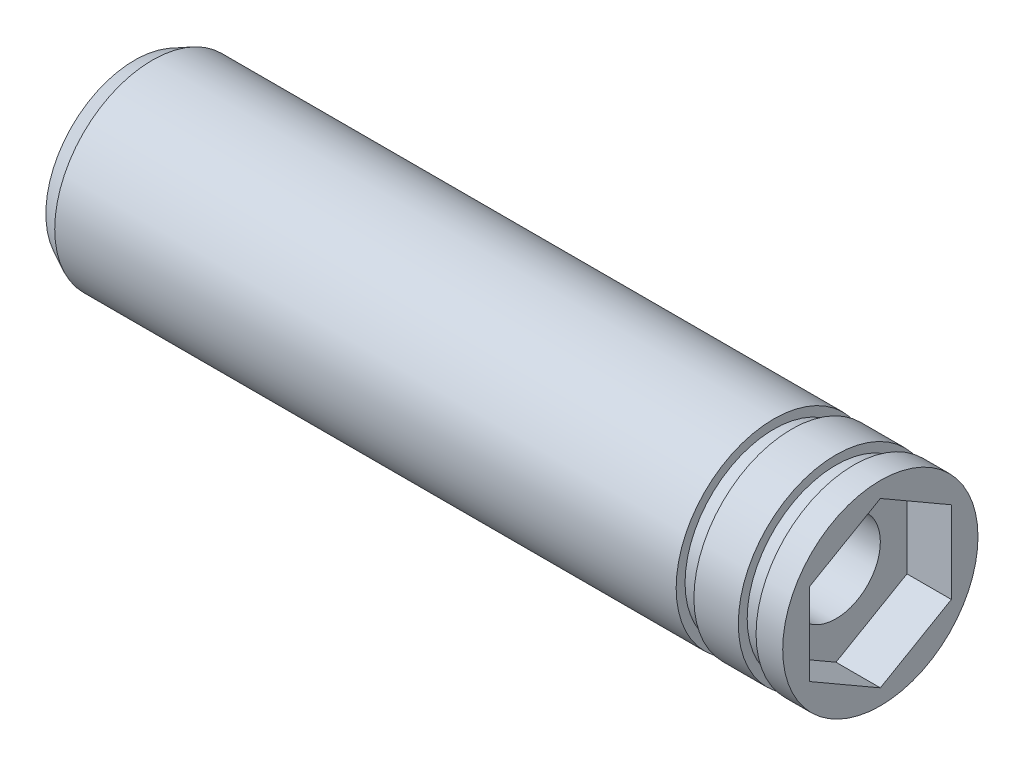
ISO-10303-21;
HEADER;
FILE_DESCRIPTION(('STEP AP214'),'2;1');
FILE_NAME('part.step','',(''),(''),'','','');
FILE_SCHEMA(('AUTOMOTIVE_DESIGN { 1 0 10303 214 1 1 1 1 }'));
ENDSEC;
DATA;
#1=APPLICATION_CONTEXT('core data for automotive mechanical design processes');
#2=APPLICATION_PROTOCOL_DEFINITION('international standard','automotive_design',2000,#1);
#3=PRODUCT_CONTEXT('',#1,'mechanical');
#4=PRODUCT('Part','Part','',(#3));
#5=PRODUCT_RELATED_PRODUCT_CATEGORY('part','',(#4));
#6=PRODUCT_DEFINITION_FORMATION('','',#4);
#7=PRODUCT_DEFINITION_CONTEXT('part definition',#1,'design');
#8=PRODUCT_DEFINITION('design','',#6,#7);
#9=PRODUCT_DEFINITION_SHAPE('','',#8);
#10=(LENGTH_UNIT() NAMED_UNIT(*) SI_UNIT(.MILLI.,.METRE.));
#11=(NAMED_UNIT(*) PLANE_ANGLE_UNIT() SI_UNIT($,.RADIAN.));
#12=(NAMED_UNIT(*) SI_UNIT($,.STERADIAN.) SOLID_ANGLE_UNIT());
#13=UNCERTAINTY_MEASURE_WITH_UNIT(LENGTH_MEASURE(1.E-05),#10,'distance_accuracy_value','');
#14=(GEOMETRIC_REPRESENTATION_CONTEXT(3) GLOBAL_UNCERTAINTY_ASSIGNED_CONTEXT((#13)) GLOBAL_UNIT_ASSIGNED_CONTEXT((#10,
#11,#12)) REPRESENTATION_CONTEXT('',''));
#15=CARTESIAN_POINT('',(0.,0.,0.));
#16=DIRECTION('',(0.,0.,1.));
#17=DIRECTION('',(1.,0.,0.));
#18=AXIS2_PLACEMENT_3D('',#15,#16,#17);
#19=CARTESIAN_POINT('',(0.,0.,0.));
#20=DIRECTION('',(1.,0.,0.));
#21=DIRECTION('',(0.,0.,-1.));
#22=AXIS2_PLACEMENT_3D('',#19,#20,#21);
#23=CYLINDRICAL_SURFACE('',#22,2.5);
#24=CARTESIAN_POINT('',(27.,0.,0.));
#25=DIRECTION('',(-1.,0.,0.));
#26=DIRECTION('',(0.,0.,1.));
#27=AXIS2_PLACEMENT_3D('',#24,#25,#26);
#28=CIRCLE('',#27,2.5);
#29=CARTESIAN_POINT('',(27.,0.,-2.5));
#30=VERTEX_POINT('',#29);
#31=EDGE_CURVE('E242',#30,#30,#28,.F.);
#32=CARTESIAN_POINT('',(39.5,0.,0.));
#33=DIRECTION('',(1.,0.,0.));
#34=DIRECTION('',(0.,0.,-1.));
#35=AXIS2_PLACEMENT_3D('',#32,#33,#34);
#36=CIRCLE('',#35,2.5);
#37=CARTESIAN_POINT('',(39.5,0.,-2.5));
#38=VERTEX_POINT('',#37);
#39=EDGE_CURVE('E28',#38,#38,#36,.F.);
#40=CARTESIAN_POINT('',(27.,0.,-2.5));
#41=CARTESIAN_POINT('',(27.1302083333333,0.,-2.5));
#42=CARTESIAN_POINT('',(27.2604166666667,0.,-2.5));
#43=CARTESIAN_POINT('',(27.5208333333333,0.,-2.5));
#44=CARTESIAN_POINT('',(27.6510416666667,0.,-2.5));
#45=CARTESIAN_POINT('',(27.9114583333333,0.,-2.5));
#46=CARTESIAN_POINT('',(28.0416666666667,0.,-2.5));
#47=CARTESIAN_POINT('',(28.3020833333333,0.,-2.5));
#48=CARTESIAN_POINT('',(28.4322916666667,0.,-2.5));
#49=CARTESIAN_POINT('',(28.6927083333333,0.,-2.5));
#50=CARTESIAN_POINT('',(28.8229166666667,0.,-2.5));
#51=CARTESIAN_POINT('',(29.0833333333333,0.,-2.5));
#52=CARTESIAN_POINT('',(29.2135416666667,0.,-2.5));
#53=CARTESIAN_POINT('',(29.4739583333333,0.,-2.5));
#54=CARTESIAN_POINT('',(29.6041666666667,0.,-2.5));
#55=CARTESIAN_POINT('',(29.8645833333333,0.,-2.5));
#56=CARTESIAN_POINT('',(29.9947916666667,0.,-2.5));
#57=CARTESIAN_POINT('',(30.2552083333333,0.,-2.5));
#58=CARTESIAN_POINT('',(30.3854166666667,0.,-2.5));
#59=CARTESIAN_POINT('',(30.6458333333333,0.,-2.5));
#60=CARTESIAN_POINT('',(30.7760416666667,0.,-2.5));
#61=CARTESIAN_POINT('',(31.0364583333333,0.,-2.5));
#62=CARTESIAN_POINT('',(31.1666666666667,0.,-2.5));
#63=CARTESIAN_POINT('',(31.4270833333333,0.,-2.5));
#64=CARTESIAN_POINT('',(31.5572916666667,0.,-2.5));
#65=CARTESIAN_POINT('',(31.8177083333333,0.,-2.5));
#66=CARTESIAN_POINT('',(31.9479166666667,0.,-2.5));
#67=CARTESIAN_POINT('',(32.2083333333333,0.,-2.5));
#68=CARTESIAN_POINT('',(32.3385416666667,0.,-2.5));
#69=CARTESIAN_POINT('',(32.5989583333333,0.,-2.5));
#70=CARTESIAN_POINT('',(32.7291666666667,0.,-2.5));
#71=CARTESIAN_POINT('',(32.9895833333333,0.,-2.5));
#72=CARTESIAN_POINT('',(33.1197916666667,0.,-2.5));
#73=CARTESIAN_POINT('',(33.3802083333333,0.,-2.5));
#74=CARTESIAN_POINT('',(33.5104166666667,0.,-2.5));
#75=CARTESIAN_POINT('',(33.7708333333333,0.,-2.5));
#76=CARTESIAN_POINT('',(33.9010416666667,0.,-2.5));
#77=CARTESIAN_POINT('',(34.1614583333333,0.,-2.5));
#78=CARTESIAN_POINT('',(34.2916666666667,0.,-2.5));
#79=CARTESIAN_POINT('',(34.5520833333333,0.,-2.5));
#80=CARTESIAN_POINT('',(34.6822916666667,0.,-2.5));
#81=CARTESIAN_POINT('',(34.9427083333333,0.,-2.5));
#82=CARTESIAN_POINT('',(35.0729166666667,0.,-2.5));
#83=CARTESIAN_POINT('',(35.3333333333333,0.,-2.5));
#84=CARTESIAN_POINT('',(35.4635416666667,0.,-2.5));
#85=CARTESIAN_POINT('',(35.7239583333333,0.,-2.5));
#86=CARTESIAN_POINT('',(35.8541666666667,0.,-2.5));
#87=CARTESIAN_POINT('',(36.1145833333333,0.,-2.5));
#88=CARTESIAN_POINT('',(36.2447916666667,0.,-2.5));
#89=CARTESIAN_POINT('',(36.5052083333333,0.,-2.5));
#90=CARTESIAN_POINT('',(36.6354166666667,0.,-2.5));
#91=CARTESIAN_POINT('',(36.8958333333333,0.,-2.5));
#92=CARTESIAN_POINT('',(37.0260416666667,0.,-2.5));
#93=CARTESIAN_POINT('',(37.2864583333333,0.,-2.5));
#94=CARTESIAN_POINT('',(37.4166666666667,0.,-2.5));
#95=CARTESIAN_POINT('',(37.6770833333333,0.,-2.5));
#96=CARTESIAN_POINT('',(37.8072916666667,0.,-2.5));
#97=CARTESIAN_POINT('',(38.0677083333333,0.,-2.5));
#98=CARTESIAN_POINT('',(38.1979166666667,0.,-2.5));
#99=CARTESIAN_POINT('',(38.4583333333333,0.,-2.5));
#100=CARTESIAN_POINT('',(38.5885416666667,0.,-2.5));
#101=CARTESIAN_POINT('',(38.8489583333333,0.,-2.5));
#102=CARTESIAN_POINT('',(38.9791666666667,0.,-2.5));
#103=CARTESIAN_POINT('',(39.2395833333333,0.,-2.5));
#104=CARTESIAN_POINT('',(39.3697916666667,0.,-2.5));
#105=CARTESIAN_POINT('',(39.5,0.,-2.5));
#106=B_SPLINE_CURVE_WITH_KNOTS('',3,(#40,#41,#42,#43,#44,#45,#46,#47,#48,#49,#50,#51,#52,#53,
#54,#55,#56,#57,#58,#59,#60,#61,#62,#63,#64,#65,#66,#67,#68,#69,#70,#71,#72,#73,#74,#75,#76,#77,
#78,#79,#80,#81,#82,#83,#84,#85,#86,#87,#88,#89,#90,#91,#92,#93,#94,#95,#96,#97,#98,#99,#100,
#101,#102,#103,#104,#105),.UNSPECIFIED.,.F.,.F.,(4,2,2,2,2,2,2,2,2,2,2,2,2,2,2,2,2,2,2,2,2,2,2,
2,2,2,2,2,2,2,2,2,4),(0.,0.390624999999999,0.781250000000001,1.171875,1.5625,1.953125,2.34375,
2.734375,3.125,3.515625,3.90625,4.296875,4.6875,5.078125,5.46875,5.859375,6.25,6.640625,7.03125,
7.421875,7.8125,8.20312499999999,8.59375,8.984375,9.375,9.765625,10.15625,10.546875,10.9375,
11.328125,11.71875,12.109375,12.5),.UNSPECIFIED.);
#107=EDGE_CURVE('BSEAM24',#30,#38,#106,.T.);
#108=ORIENTED_EDGE('',*,*,#31,.F.);
#109=ORIENTED_EDGE('',*,*,#39,.F.);
#110=ORIENTED_EDGE('',*,*,#107,.T.);
#111=ORIENTED_EDGE('',*,*,#107,.F.);
#112=EDGE_LOOP('',(#108,#110,#109,#111));
#113=FACE_BOUND('',#112,.T.);
#114=ADVANCED_FACE('F24',(#113),#23,.F.);
#115=CARTESIAN_POINT('',(20.,-3.75277674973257,0.));
#116=DIRECTION('',(0.,-0.866025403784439,0.5));
#117=DIRECTION('',(0.,-0.5,-0.866025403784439));
#118=AXIS2_PLACEMENT_3D('',#115,#116,#117);
#119=PLANE('',#118);
#120=DIRECTION('',(0.,0.5,0.866025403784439));
#121=VECTOR('',#120,1.);
#122=CARTESIAN_POINT('',(7.,-3.75277674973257,0.));
#123=LINE('',#122,#121);
#124=CARTESIAN_POINT('',(7.,-3.75277674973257,0.));
#125=VERTEX_POINT('',#124);
#126=CARTESIAN_POINT('',(7.,-1.87638837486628,3.25));
#127=VERTEX_POINT('',#126);
#128=EDGE_CURVE('E225',#125,#127,#123,.T.);
#129=ORIENTED_EDGE('',*,*,#128,.F.);
#130=DIRECTION('',(-1.,0.,0.));
#131=VECTOR('',#130,1.);
#132=CARTESIAN_POINT('',(20.,-3.75277674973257,0.));
#133=LINE('',#132,#131);
#134=CARTESIAN_POINT('',(0.,-3.75277674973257,0.));
#135=VERTEX_POINT('',#134);
#136=EDGE_CURVE('E281',#125,#135,#133,.T.);
#137=ORIENTED_EDGE('',*,*,#136,.T.);
#138=DIRECTION('',(0.,0.5,0.866025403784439));
#139=VECTOR('',#138,1.);
#140=CARTESIAN_POINT('',(0.,-3.75277674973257,0.));
#141=LINE('',#140,#139);
#142=CARTESIAN_POINT('',(0.,-1.87638837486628,3.25));
#143=VERTEX_POINT('',#142);
#144=EDGE_CURVE('E243',#135,#143,#141,.T.);
#145=ORIENTED_EDGE('',*,*,#144,.T.);
#146=DIRECTION('',(-1.,0.,0.));
#147=VECTOR('',#146,1.);
#148=CARTESIAN_POINT('',(20.,-1.87638837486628,3.25));
#149=LINE('',#148,#147);
#150=EDGE_CURVE('E48',#127,#143,#149,.T.);
#151=ORIENTED_EDGE('',*,*,#150,.F.);
#152=EDGE_LOOP('',(#129,#137,#145,#151));
#153=FACE_BOUND('',#152,.T.);
#154=ADVANCED_FACE('F375',(#153),#119,.F.);
#155=DIRECTION('',(0.,-0.5,-0.866025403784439));
#156=VECTOR('',#155,1.);
#157=CARTESIAN_POINT('',(8.,-3.75277674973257,0.));
#158=LINE('',#157,#156);
#159=CARTESIAN_POINT('',(8.,-1.87638837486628,3.25));
#160=VERTEX_POINT('',#159);
#161=CARTESIAN_POINT('',(8.,-3.75277674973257,0.));
#162=VERTEX_POINT('',#161);
#163=EDGE_CURVE('E223',#160,#162,#158,.T.);
#164=ORIENTED_EDGE('',*,*,#163,.F.);
#165=CARTESIAN_POINT('',(20.,-1.87638837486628,3.25));
#166=VERTEX_POINT('',#165);
#167=EDGE_CURVE('E298',#166,#160,#149,.T.);
#168=ORIENTED_EDGE('',*,*,#167,.F.);
#169=DIRECTION('',(0.,0.5,0.866025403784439));
#170=VECTOR('',#169,1.);
#171=CARTESIAN_POINT('',(20.,-3.75277674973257,0.));
#172=LINE('',#171,#170);
#173=CARTESIAN_POINT('',(20.,-3.75277674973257,0.));
#174=VERTEX_POINT('',#173);
#175=EDGE_CURVE('E259',#174,#166,#172,.T.);
#176=ORIENTED_EDGE('',*,*,#175,.F.);
#177=EDGE_CURVE('E277',#174,#162,#133,.T.);
#178=ORIENTED_EDGE('',*,*,#177,.T.);
#179=EDGE_LOOP('',(#164,#168,#176,#178));
#180=FACE_BOUND('',#179,.T.);
#181=ADVANCED_FACE('F343',(#180),#119,.F.);
#182=CARTESIAN_POINT('',(20.,-1.87638837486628,-3.25));
#183=DIRECTION('',(0.,-0.866025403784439,-0.5));
#184=DIRECTION('',(0.,0.5,-0.866025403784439));
#185=AXIS2_PLACEMENT_3D('',#182,#183,#184);
#186=PLANE('',#185);
#187=DIRECTION('',(0.,-0.5,0.866025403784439));
#188=VECTOR('',#187,1.);
#189=CARTESIAN_POINT('',(7.,-1.87638837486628,-3.25));
#190=LINE('',#189,#188);
#191=CARTESIAN_POINT('',(7.,-1.87638837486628,-3.25));
#192=VERTEX_POINT('',#191);
#193=EDGE_CURVE('E229',#192,#125,#190,.T.);
#194=ORIENTED_EDGE('',*,*,#193,.F.);
#195=DIRECTION('',(-1.,0.,0.));
#196=VECTOR('',#195,1.);
#197=CARTESIAN_POINT('',(20.,-1.87638837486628,-3.25));
#198=LINE('',#197,#196);
#199=CARTESIAN_POINT('',(0.,-1.87638837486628,-3.25));
#200=VERTEX_POINT('',#199);
#201=EDGE_CURVE('E285',#192,#200,#198,.T.);
#202=ORIENTED_EDGE('',*,*,#201,.T.);
#203=DIRECTION('',(0.,-0.5,0.866025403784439));
#204=VECTOR('',#203,1.);
#205=CARTESIAN_POINT('',(0.,-1.87638837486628,-3.25));
#206=LINE('',#205,#204);
#207=EDGE_CURVE('E256',#200,#135,#206,.T.);
#208=ORIENTED_EDGE('',*,*,#207,.T.);
#209=ORIENTED_EDGE('',*,*,#136,.F.);
#210=EDGE_LOOP('',(#194,#202,#208,#209));
#211=FACE_BOUND('',#210,.T.);
#212=ADVANCED_FACE('F394',(#211),#186,.F.);
#213=DIRECTION('',(0.,0.5,-0.866025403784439));
#214=VECTOR('',#213,1.);
#215=CARTESIAN_POINT('',(8.,-1.87638837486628,-3.25));
#216=LINE('',#215,#214);
#217=CARTESIAN_POINT('',(8.,-1.87638837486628,-3.25));
#218=VERTEX_POINT('',#217);
#219=EDGE_CURVE('E221',#162,#218,#216,.T.);
#220=ORIENTED_EDGE('',*,*,#219,.F.);
#221=ORIENTED_EDGE('',*,*,#177,.F.);
#222=DIRECTION('',(0.,-0.5,0.866025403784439));
#223=VECTOR('',#222,1.);
#224=CARTESIAN_POINT('',(20.,-1.87638837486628,-3.25));
#225=LINE('',#224,#223);
#226=CARTESIAN_POINT('',(20.,-1.87638837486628,-3.25));
#227=VERTEX_POINT('',#226);
#228=EDGE_CURVE('E274',#227,#174,#225,.T.);
#229=ORIENTED_EDGE('',*,*,#228,.F.);
#230=EDGE_CURVE('E282',#227,#218,#198,.T.);
#231=ORIENTED_EDGE('',*,*,#230,.T.);
#232=EDGE_LOOP('',(#220,#221,#229,#231));
#233=FACE_BOUND('',#232,.T.);
#234=ADVANCED_FACE('F353',(#233),#186,.F.);
#235=CARTESIAN_POINT('',(20.,1.87638837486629,-3.25));
#236=DIRECTION('',(0.,0.,-1.));
#237=DIRECTION('',(0.,1.,0.));
#238=AXIS2_PLACEMENT_3D('',#235,#236,#237);
#239=PLANE('',#238);
#240=DIRECTION('',(0.,-1.,0.));
#241=VECTOR('',#240,1.);
#242=CARTESIAN_POINT('',(7.,1.87638837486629,-3.25));
#243=LINE('',#242,#241);
#244=CARTESIAN_POINT('',(7.,1.87638837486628,-3.25));
#245=VERTEX_POINT('',#244);
#246=EDGE_CURVE('E233',#245,#192,#243,.T.);
#247=ORIENTED_EDGE('',*,*,#246,.F.);
#248=DIRECTION('',(-1.,0.,0.));
#249=VECTOR('',#248,1.);
#250=CARTESIAN_POINT('',(20.,1.87638837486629,-3.25));
#251=LINE('',#250,#249);
#252=CARTESIAN_POINT('',(0.,1.87638837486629,-3.25));
#253=VERTEX_POINT('',#252);
#254=EDGE_CURVE('E289',#245,#253,#251,.T.);
#255=ORIENTED_EDGE('',*,*,#254,.T.);
#256=DIRECTION('',(0.,-1.,0.));
#257=VECTOR('',#256,1.);
#258=CARTESIAN_POINT('',(0.,1.87638837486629,-3.25));
#259=LINE('',#258,#257);
#260=EDGE_CURVE('E253',#253,#200,#259,.T.);
#261=ORIENTED_EDGE('',*,*,#260,.T.);
#262=ORIENTED_EDGE('',*,*,#201,.F.);
#263=EDGE_LOOP('',(#247,#255,#261,#262));
#264=FACE_BOUND('',#263,.T.);
#265=ADVANCED_FACE('F398',(#264),#239,.F.);
#266=DIRECTION('',(0.,1.,0.));
#267=VECTOR('',#266,1.);
#268=CARTESIAN_POINT('',(8.,1.87638837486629,-3.25));
#269=LINE('',#268,#267);
#270=CARTESIAN_POINT('',(8.,1.87638837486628,-3.25));
#271=VERTEX_POINT('',#270);
#272=EDGE_CURVE('E219',#218,#271,#269,.T.);
#273=ORIENTED_EDGE('',*,*,#272,.F.);
#274=ORIENTED_EDGE('',*,*,#230,.F.);
#275=DIRECTION('',(0.,-1.,0.));
#276=VECTOR('',#275,1.);
#277=CARTESIAN_POINT('',(20.,1.87638837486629,-3.25));
#278=LINE('',#277,#276);
#279=CARTESIAN_POINT('',(20.,1.87638837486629,-3.25));
#280=VERTEX_POINT('',#279);
#281=EDGE_CURVE('E271',#280,#227,#278,.T.);
#282=ORIENTED_EDGE('',*,*,#281,.F.);
#283=EDGE_CURVE('E286',#280,#271,#251,.T.);
#284=ORIENTED_EDGE('',*,*,#283,.T.);
#285=EDGE_LOOP('',(#273,#274,#282,#284));
#286=FACE_BOUND('',#285,.T.);
#287=ADVANCED_FACE('F357',(#286),#239,.F.);
#288=CARTESIAN_POINT('',(20.,3.75277674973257,0.));
#289=DIRECTION('',(0.,0.866025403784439,-0.5));
#290=DIRECTION('',(0.,0.5,0.866025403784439));
#291=AXIS2_PLACEMENT_3D('',#288,#289,#290);
#292=PLANE('',#291);
#293=DIRECTION('',(0.,-0.5,-0.866025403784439));
#294=VECTOR('',#293,1.);
#295=CARTESIAN_POINT('',(7.,3.75277674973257,0.));
#296=LINE('',#295,#294);
#297=CARTESIAN_POINT('',(7.,3.75277674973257,0.));
#298=VERTEX_POINT('',#297);
#299=EDGE_CURVE('E231',#298,#245,#296,.T.);
#300=ORIENTED_EDGE('',*,*,#299,.F.);
#301=DIRECTION('',(-1.,0.,0.));
#302=VECTOR('',#301,1.);
#303=CARTESIAN_POINT('',(20.,3.75277674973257,0.));
#304=LINE('',#303,#302);
#305=CARTESIAN_POINT('',(0.,3.75277674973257,0.));
#306=VERTEX_POINT('',#305);
#307=EDGE_CURVE('E293',#298,#306,#304,.T.);
#308=ORIENTED_EDGE('',*,*,#307,.T.);
#309=DIRECTION('',(0.,-0.5,-0.866025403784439));
#310=VECTOR('',#309,1.);
#311=CARTESIAN_POINT('',(0.,3.75277674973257,0.));
#312=LINE('',#311,#310);
#313=EDGE_CURVE('E250',#306,#253,#312,.T.);
#314=ORIENTED_EDGE('',*,*,#313,.T.);
#315=ORIENTED_EDGE('',*,*,#254,.F.);
#316=EDGE_LOOP('',(#300,#308,#314,#315));
#317=FACE_BOUND('',#316,.T.);
#318=ADVANCED_FACE('F401',(#317),#292,.F.);
#319=DIRECTION('',(0.,0.5,0.866025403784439));
#320=VECTOR('',#319,1.);
#321=CARTESIAN_POINT('',(8.,3.75277674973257,0.));
#322=LINE('',#321,#320);
#323=CARTESIAN_POINT('',(8.,3.75277674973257,0.));
#324=VERTEX_POINT('',#323);
#325=EDGE_CURVE('E217',#271,#324,#322,.T.);
#326=ORIENTED_EDGE('',*,*,#325,.F.);
#327=ORIENTED_EDGE('',*,*,#283,.F.);
#328=DIRECTION('',(0.,-0.5,-0.866025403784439));
#329=VECTOR('',#328,1.);
#330=CARTESIAN_POINT('',(20.,3.75277674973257,0.));
#331=LINE('',#330,#329);
#332=CARTESIAN_POINT('',(20.,3.75277674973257,0.));
#333=VERTEX_POINT('',#332);
#334=EDGE_CURVE('E268',#333,#280,#331,.T.);
#335=ORIENTED_EDGE('',*,*,#334,.F.);
#336=EDGE_CURVE('E290',#333,#324,#304,.T.);
#337=ORIENTED_EDGE('',*,*,#336,.T.);
#338=EDGE_LOOP('',(#326,#327,#335,#337));
#339=FACE_BOUND('',#338,.T.);
#340=ADVANCED_FACE('F360',(#339),#292,.F.);
#341=CARTESIAN_POINT('',(20.,1.87638837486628,3.25));
#342=DIRECTION('',(0.,0.866025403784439,0.5));
#343=DIRECTION('',(0.,-0.5,0.866025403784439));
#344=AXIS2_PLACEMENT_3D('',#341,#342,#343);
#345=PLANE('',#344);
#346=DIRECTION('',(0.,0.5,-0.866025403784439));
#347=VECTOR('',#346,1.);
#348=CARTESIAN_POINT('',(7.,1.87638837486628,3.25));
#349=LINE('',#348,#347);
#350=CARTESIAN_POINT('',(7.,1.87638837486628,3.25));
#351=VERTEX_POINT('',#350);
#352=EDGE_CURVE('E226',#351,#298,#349,.T.);
#353=ORIENTED_EDGE('',*,*,#352,.F.);
#354=DIRECTION('',(-1.,0.,0.));
#355=VECTOR('',#354,1.);
#356=CARTESIAN_POINT('',(20.,1.87638837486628,3.25));
#357=LINE('',#356,#355);
#358=CARTESIAN_POINT('',(0.,1.87638837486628,3.25));
#359=VERTEX_POINT('',#358);
#360=EDGE_CURVE('E297',#351,#359,#357,.T.);
#361=ORIENTED_EDGE('',*,*,#360,.T.);
#362=DIRECTION('',(0.,0.5,-0.866025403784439));
#363=VECTOR('',#362,1.);
#364=CARTESIAN_POINT('',(0.,1.87638837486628,3.25));
#365=LINE('',#364,#363);
#366=EDGE_CURVE('E247',#359,#306,#365,.T.);
#367=ORIENTED_EDGE('',*,*,#366,.T.);
#368=ORIENTED_EDGE('',*,*,#307,.F.);
#369=EDGE_LOOP('',(#353,#361,#367,#368));
#370=FACE_BOUND('',#369,.T.);
#371=ADVANCED_FACE('F365',(#370),#345,.F.);
#372=DIRECTION('',(0.,-0.5,0.866025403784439));
#373=VECTOR('',#372,1.);
#374=CARTESIAN_POINT('',(8.,1.87638837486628,3.25));
#375=LINE('',#374,#373);
#376=CARTESIAN_POINT('',(8.,1.87638837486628,3.25));
#377=VERTEX_POINT('',#376);
#378=EDGE_CURVE('E215',#324,#377,#375,.T.);
#379=ORIENTED_EDGE('',*,*,#378,.F.);
#380=ORIENTED_EDGE('',*,*,#336,.F.);
#381=DIRECTION('',(0.,0.5,-0.866025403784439));
#382=VECTOR('',#381,1.);
#383=CARTESIAN_POINT('',(20.,1.87638837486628,3.25));
#384=LINE('',#383,#382);
#385=CARTESIAN_POINT('',(20.,1.87638837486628,3.25));
#386=VERTEX_POINT('',#385);
#387=EDGE_CURVE('E265',#386,#333,#384,.T.);
#388=ORIENTED_EDGE('',*,*,#387,.F.);
#389=EDGE_CURVE('E294',#386,#377,#357,.T.);
#390=ORIENTED_EDGE('',*,*,#389,.T.);
#391=EDGE_LOOP('',(#379,#380,#388,#390));
#392=FACE_BOUND('',#391,.T.);
#393=ADVANCED_FACE('F362',(#392),#345,.F.);
#394=CARTESIAN_POINT('',(20.,-1.87638837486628,3.25));
#395=DIRECTION('',(0.,0.,1.));
#396=DIRECTION('',(0.,-1.,0.));
#397=AXIS2_PLACEMENT_3D('',#394,#395,#396);
#398=PLANE('',#397);
#399=DIRECTION('',(0.,1.,0.));
#400=VECTOR('',#399,1.);
#401=CARTESIAN_POINT('',(7.,-1.87638837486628,3.25));
#402=LINE('',#401,#400);
#403=EDGE_CURVE('E11',#127,#351,#402,.T.);
#404=ORIENTED_EDGE('',*,*,#403,.F.);
#405=ORIENTED_EDGE('',*,*,#150,.T.);
#406=DIRECTION('',(0.,1.,0.));
#407=VECTOR('',#406,1.);
#408=CARTESIAN_POINT('',(0.,-1.87638837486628,3.25));
#409=LINE('',#408,#407);
#410=EDGE_CURVE('E245',#143,#359,#409,.T.);
#411=ORIENTED_EDGE('',*,*,#410,.T.);
#412=ORIENTED_EDGE('',*,*,#360,.F.);
#413=EDGE_LOOP('',(#404,#405,#411,#412));
#414=FACE_BOUND('',#413,.T.);
#415=ADVANCED_FACE('F364',(#414),#398,.F.);
#416=DIRECTION('',(0.,-1.,0.));
#417=VECTOR('',#416,1.);
#418=CARTESIAN_POINT('',(8.,-1.87638837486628,3.25));
#419=LINE('',#418,#417);
#420=EDGE_CURVE('E33',#377,#160,#419,.T.);
#421=ORIENTED_EDGE('',*,*,#420,.F.);
#422=ORIENTED_EDGE('',*,*,#389,.F.);
#423=DIRECTION('',(0.,1.,0.));
#424=VECTOR('',#423,1.);
#425=CARTESIAN_POINT('',(20.,-1.87638837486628,3.25));
#426=LINE('',#425,#424);
#427=EDGE_CURVE('E262',#166,#386,#426,.T.);
#428=ORIENTED_EDGE('',*,*,#427,.F.);
#429=ORIENTED_EDGE('',*,*,#167,.T.);
#430=EDGE_LOOP('',(#421,#422,#428,#429));
#431=FACE_BOUND('',#430,.T.);
#432=ADVANCED_FACE('F346',(#431),#398,.F.);
#433=CARTESIAN_POINT('',(0.,0.,0.));
#434=DIRECTION('',(1.,0.,0.));
#435=DIRECTION('',(0.,0.,-1.));
#436=AXIS2_PLACEMENT_3D('',#433,#434,#435);
#437=PLANE('',#436);
#438=ORIENTED_EDGE('',*,*,#410,.F.);
#439=ORIENTED_EDGE('',*,*,#144,.F.);
#440=ORIENTED_EDGE('',*,*,#207,.F.);
#441=ORIENTED_EDGE('',*,*,#260,.F.);
#442=ORIENTED_EDGE('',*,*,#313,.F.);
#443=ORIENTED_EDGE('',*,*,#366,.F.);
#444=EDGE_LOOP('',(#438,#439,#440,#441,#442,#443));
#445=FACE_BOUND('',#444,.T.);
#446=CARTESIAN_POINT('',(0.,0.,0.));
#447=DIRECTION('',(1.,0.,0.));
#448=DIRECTION('',(0.,0.,-1.));
#449=AXIS2_PLACEMENT_3D('',#446,#447,#448);
#450=CIRCLE('',#449,5.);
#451=CARTESIAN_POINT('',(0.,0.,-5.));
#452=VERTEX_POINT('',#451);
#453=EDGE_CURVE('E327',#452,#452,#450,.F.);
#454=ORIENTED_EDGE('',*,*,#453,.T.);
#455=EDGE_LOOP('',(#454));
#456=FACE_BOUND('',#455,.T.);
#457=ADVANCED_FACE('F26',(#445,#456),#437,.F.);
#458=CARTESIAN_POINT('',(0.,0.,0.));
#459=DIRECTION('',(-1.,0.,0.));
#460=DIRECTION('',(0.,0.,1.));
#461=AXIS2_PLACEMENT_3D('',#458,#459,#460);
#462=CYLINDRICAL_SURFACE('',#461,5.5);
#463=CARTESIAN_POINT('',(1.,0.,0.));
#464=DIRECTION('',(1.,0.,0.));
#465=DIRECTION('',(0.,0.,-1.));
#466=AXIS2_PLACEMENT_3D('',#463,#464,#465);
#467=CIRCLE('',#466,5.5);
#468=CARTESIAN_POINT('',(1.,0.,-5.5));
#469=VERTEX_POINT('',#468);
#470=EDGE_CURVE('E330',#469,#469,#467,.T.);
#471=ORIENTED_EDGE('',*,*,#470,.T.);
#472=EDGE_LOOP('',(#471));
#473=FACE_BOUND('',#472,.T.);
#474=CARTESIAN_POINT('',(36.,0.,0.));
#475=DIRECTION('',(-1.,0.,0.));
#476=DIRECTION('',(0.,0.,1.));
#477=AXIS2_PLACEMENT_3D('',#474,#475,#476);
#478=CIRCLE('',#477,5.5);
#479=CARTESIAN_POINT('',(36.,0.,5.5));
#480=VERTEX_POINT('',#479);
#481=EDGE_CURVE('E324',#480,#480,#478,.T.);
#482=ORIENTED_EDGE('',*,*,#481,.T.);
#483=EDGE_LOOP('',(#482));
#484=FACE_BOUND('',#483,.T.);
#485=ADVANCED_FACE('F427',(#473,#484),#462,.T.);
#486=CARTESIAN_POINT('',(36.,5.5,0.));
#487=DIRECTION('',(-1.,0.,0.));
#488=DIRECTION('',(0.,0.,1.));
#489=AXIS2_PLACEMENT_3D('',#486,#487,#488);
#490=PLANE('',#489);
#491=ORIENTED_EDGE('',*,*,#481,.F.);
#492=EDGE_LOOP('',(#491));
#493=FACE_BOUND('',#492,.T.);
#494=CARTESIAN_POINT('',(36.,0.,0.));
#495=DIRECTION('',(-1.,0.,0.));
#496=DIRECTION('',(0.,0.,1.));
#497=AXIS2_PLACEMENT_3D('',#494,#495,#496);
#498=CIRCLE('',#497,5.);
#499=CARTESIAN_POINT('',(36.,0.,5.));
#500=VERTEX_POINT('',#499);
#501=EDGE_CURVE('E321',#500,#500,#498,.T.);
#502=ORIENTED_EDGE('',*,*,#501,.T.);
#503=EDGE_LOOP('',(#502));
#504=FACE_BOUND('',#503,.T.);
#505=ADVANCED_FACE('F466',(#493,#504),#490,.F.);
#506=CARTESIAN_POINT('',(0.,0.,0.));
#507=DIRECTION('',(-1.,0.,0.));
#508=DIRECTION('',(0.,0.,1.));
#509=AXIS2_PLACEMENT_3D('',#506,#507,#508);
#510=CYLINDRICAL_SURFACE('',#509,5.);
#511=ORIENTED_EDGE('',*,*,#501,.F.);
#512=EDGE_LOOP('',(#511));
#513=FACE_BOUND('',#512,.T.);
#514=CARTESIAN_POINT('',(37.,0.,0.));
#515=DIRECTION('',(-1.,0.,0.));
#516=DIRECTION('',(0.,0.,1.));
#517=AXIS2_PLACEMENT_3D('',#514,#515,#516);
#518=CIRCLE('',#517,5.);
#519=CARTESIAN_POINT('',(37.,0.,5.));
#520=VERTEX_POINT('',#519);
#521=EDGE_CURVE('E318',#520,#520,#518,.T.);
#522=ORIENTED_EDGE('',*,*,#521,.T.);
#523=EDGE_LOOP('',(#522));
#524=FACE_BOUND('',#523,.T.);
#525=ADVANCED_FACE('F462',(#513,#524),#510,.T.);
#526=CARTESIAN_POINT('',(37.,5.,0.));
#527=DIRECTION('',(1.,0.,0.));
#528=DIRECTION('',(0.,0.,-1.));
#529=AXIS2_PLACEMENT_3D('',#526,#527,#528);
#530=PLANE('',#529);
#531=ORIENTED_EDGE('',*,*,#521,.F.);
#532=EDGE_LOOP('',(#531));
#533=FACE_BOUND('',#532,.T.);
#534=CARTESIAN_POINT('',(37.,0.,0.));
#535=DIRECTION('',(-1.,0.,0.));
#536=DIRECTION('',(0.,0.,1.));
#537=AXIS2_PLACEMENT_3D('',#534,#535,#536);
#538=CIRCLE('',#537,5.5);
#539=CARTESIAN_POINT('',(37.,0.,5.5));
#540=VERTEX_POINT('',#539);
#541=EDGE_CURVE('E315',#540,#540,#538,.T.);
#542=ORIENTED_EDGE('',*,*,#541,.T.);
#543=EDGE_LOOP('',(#542));
#544=FACE_BOUND('',#543,.T.);
#545=ADVANCED_FACE('F458',(#533,#544),#530,.F.);
#546=CARTESIAN_POINT('',(0.,0.,0.));
#547=DIRECTION('',(-1.,0.,0.));
#548=DIRECTION('',(0.,0.,1.));
#549=AXIS2_PLACEMENT_3D('',#546,#547,#548);
#550=CYLINDRICAL_SURFACE('',#549,5.5);
#551=ORIENTED_EDGE('',*,*,#541,.F.);
#552=EDGE_LOOP('',(#551));
#553=FACE_BOUND('',#552,.T.);
#554=CARTESIAN_POINT('',(39.5,0.,0.));
#555=DIRECTION('',(-1.,0.,0.));
#556=DIRECTION('',(0.,0.,1.));
#557=AXIS2_PLACEMENT_3D('',#554,#555,#556);
#558=CIRCLE('',#557,5.5);
#559=CARTESIAN_POINT('',(39.5,0.,5.5));
#560=VERTEX_POINT('',#559);
#561=EDGE_CURVE('E312',#560,#560,#558,.T.);
#562=ORIENTED_EDGE('',*,*,#561,.T.);
#563=EDGE_LOOP('',(#562));
#564=FACE_BOUND('',#563,.T.);
#565=ADVANCED_FACE('F454',(#553,#564),#550,.T.);
#566=CARTESIAN_POINT('',(39.5,5.5,0.));
#567=DIRECTION('',(-1.,0.,0.));
#568=DIRECTION('',(0.,0.,1.));
#569=AXIS2_PLACEMENT_3D('',#566,#567,#568);
#570=PLANE('',#569);
#571=ORIENTED_EDGE('',*,*,#561,.F.);
#572=EDGE_LOOP('',(#571));
#573=FACE_BOUND('',#572,.T.);
#574=CARTESIAN_POINT('',(39.5,0.,0.));
#575=DIRECTION('',(-1.,0.,0.));
#576=DIRECTION('',(0.,0.,1.));
#577=AXIS2_PLACEMENT_3D('',#574,#575,#576);
#578=CIRCLE('',#577,5.);
#579=CARTESIAN_POINT('',(39.5,0.,5.));
#580=VERTEX_POINT('',#579);
#581=EDGE_CURVE('E309',#580,#580,#578,.T.);
#582=ORIENTED_EDGE('',*,*,#581,.T.);
#583=EDGE_LOOP('',(#582));
#584=FACE_BOUND('',#583,.T.);
#585=ADVANCED_FACE('F450',(#573,#584),#570,.F.);
#586=CARTESIAN_POINT('',(0.,0.,0.));
#587=DIRECTION('',(-1.,0.,0.));
#588=DIRECTION('',(0.,0.,1.));
#589=AXIS2_PLACEMENT_3D('',#586,#587,#588);
#590=CYLINDRICAL_SURFACE('',#589,5.);
#591=ORIENTED_EDGE('',*,*,#581,.F.);
#592=EDGE_LOOP('',(#591));
#593=FACE_BOUND('',#592,.T.);
#594=CARTESIAN_POINT('',(40.5,0.,0.));
#595=DIRECTION('',(-1.,0.,0.));
#596=DIRECTION('',(0.,0.,1.));
#597=AXIS2_PLACEMENT_3D('',#594,#595,#596);
#598=CIRCLE('',#597,5.);
#599=CARTESIAN_POINT('',(40.5,0.,5.));
#600=VERTEX_POINT('',#599);
#601=EDGE_CURVE('E306',#600,#600,#598,.T.);
#602=ORIENTED_EDGE('',*,*,#601,.T.);
#603=EDGE_LOOP('',(#602));
#604=FACE_BOUND('',#603,.T.);
#605=ADVANCED_FACE('F446',(#593,#604),#590,.T.);
#606=CARTESIAN_POINT('',(40.5,5.,0.));
#607=DIRECTION('',(1.,0.,0.));
#608=DIRECTION('',(0.,0.,-1.));
#609=AXIS2_PLACEMENT_3D('',#606,#607,#608);
#610=PLANE('',#609);
#611=ORIENTED_EDGE('',*,*,#601,.F.);
#612=EDGE_LOOP('',(#611));
#613=FACE_BOUND('',#612,.T.);
#614=CARTESIAN_POINT('',(40.5,0.,0.));
#615=DIRECTION('',(-1.,0.,0.));
#616=DIRECTION('',(0.,0.,1.));
#617=AXIS2_PLACEMENT_3D('',#614,#615,#616);
#618=CIRCLE('',#617,5.5);
#619=CARTESIAN_POINT('',(40.5,0.,5.5));
#620=VERTEX_POINT('',#619);
#621=EDGE_CURVE('E303',#620,#620,#618,.T.);
#622=ORIENTED_EDGE('',*,*,#621,.T.);
#623=EDGE_LOOP('',(#622));
#624=FACE_BOUND('',#623,.T.);
#625=ADVANCED_FACE('F442',(#613,#624),#610,.F.);
#626=CARTESIAN_POINT('',(0.,0.,0.));
#627=DIRECTION('',(-1.,0.,0.));
#628=DIRECTION('',(0.,0.,1.));
#629=AXIS2_PLACEMENT_3D('',#626,#627,#628);
#630=CYLINDRICAL_SURFACE('',#629,5.5);
#631=ORIENTED_EDGE('',*,*,#621,.F.);
#632=EDGE_LOOP('',(#631));
#633=FACE_BOUND('',#632,.T.);
#634=CARTESIAN_POINT('',(42.,0.,0.));
#635=DIRECTION('',(-1.,0.,0.));
#636=DIRECTION('',(0.,0.,1.));
#637=AXIS2_PLACEMENT_3D('',#634,#635,#636);
#638=CIRCLE('',#637,5.5);
#639=CARTESIAN_POINT('',(42.,0.,5.5));
#640=VERTEX_POINT('',#639);
#641=EDGE_CURVE('E280',#640,#640,#638,.T.);
#642=ORIENTED_EDGE('',*,*,#641,.T.);
#643=EDGE_LOOP('',(#642));
#644=FACE_BOUND('',#643,.T.);
#645=ADVANCED_FACE('F436',(#633,#644),#630,.T.);
#646=CARTESIAN_POINT('',(42.,5.5,0.));
#647=DIRECTION('',(-1.,0.,0.));
#648=DIRECTION('',(0.,0.,1.));
#649=AXIS2_PLACEMENT_3D('',#646,#647,#648);
#650=PLANE('',#649);
#651=DIRECTION('',(0.,0.5,-0.866025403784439));
#652=VECTOR('',#651,1.);
#653=CARTESIAN_POINT('',(42.,-4.61880215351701,0.));
#654=LINE('',#653,#652);
#655=CARTESIAN_POINT('',(42.,-4.61880215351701,0.));
#656=VERTEX_POINT('',#655);
#657=CARTESIAN_POINT('',(42.,-2.3094010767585,-4.));
#658=VERTEX_POINT('',#657);
#659=EDGE_CURVE('E167',#656,#658,#654,.T.);
#660=ORIENTED_EDGE('',*,*,#659,.F.);
#661=DIRECTION('',(0.,-0.5,-0.866025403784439));
#662=VECTOR('',#661,1.);
#663=CARTESIAN_POINT('',(42.,-2.30940107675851,4.));
#664=LINE('',#663,#662);
#665=CARTESIAN_POINT('',(42.,-2.30940107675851,4.));
#666=VERTEX_POINT('',#665);
#667=EDGE_CURVE('E40',#666,#656,#664,.T.);
#668=ORIENTED_EDGE('',*,*,#667,.F.);
#669=DIRECTION('',(0.,-1.,0.));
#670=VECTOR('',#669,1.);
#671=CARTESIAN_POINT('',(42.,2.3094010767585,4.));
#672=LINE('',#671,#670);
#673=CARTESIAN_POINT('',(42.,2.3094010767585,4.));
#674=VERTEX_POINT('',#673);
#675=EDGE_CURVE('E183',#674,#666,#672,.T.);
#676=ORIENTED_EDGE('',*,*,#675,.F.);
#677=DIRECTION('',(0.,-0.5,0.866025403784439));
#678=VECTOR('',#677,1.);
#679=CARTESIAN_POINT('',(42.,4.618802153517,0.));
#680=LINE('',#679,#678);
#681=CARTESIAN_POINT('',(42.,4.618802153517,0.));
#682=VERTEX_POINT('',#681);
#683=EDGE_CURVE('E177',#682,#674,#680,.T.);
#684=ORIENTED_EDGE('',*,*,#683,.F.);
#685=DIRECTION('',(0.,0.5,0.866025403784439));
#686=VECTOR('',#685,1.);
#687=CARTESIAN_POINT('',(42.,2.3094010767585,-4.));
#688=LINE('',#687,#686);
#689=CARTESIAN_POINT('',(42.,2.3094010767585,-4.));
#690=VERTEX_POINT('',#689);
#691=EDGE_CURVE('E175',#690,#682,#688,.T.);
#692=ORIENTED_EDGE('',*,*,#691,.F.);
#693=DIRECTION('',(0.,1.,0.));
#694=VECTOR('',#693,1.);
#695=CARTESIAN_POINT('',(42.,-2.3094010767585,-4.));
#696=LINE('',#695,#694);
#697=EDGE_CURVE('E156',#658,#690,#696,.T.);
#698=ORIENTED_EDGE('',*,*,#697,.F.);
#699=EDGE_LOOP('',(#660,#668,#676,#684,#692,#698));
#700=FACE_BOUND('',#699,.T.);
#701=ORIENTED_EDGE('',*,*,#641,.F.);
#702=EDGE_LOOP('',(#701));
#703=FACE_BOUND('',#702,.T.);
#704=ADVANCED_FACE('F171',(#700,#703),#650,.F.);
#705=CARTESIAN_POINT('',(0.,0.,0.));
#706=DIRECTION('',(1.,0.,0.));
#707=DIRECTION('',(0.,0.,-1.));
#708=AXIS2_PLACEMENT_3D('',#705,#706,#707);
#709=CONICAL_SURFACE('',#708,5.,0.463647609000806);
#710=ORIENTED_EDGE('',*,*,#470,.F.);
#711=EDGE_LOOP('',(#710));
#712=FACE_BOUND('',#711,.T.);
#713=ORIENTED_EDGE('',*,*,#453,.F.);
#714=EDGE_LOOP('',(#713));
#715=FACE_BOUND('',#714,.T.);
#716=ADVANCED_FACE('F392',(#712,#715),#709,.T.);
#717=CARTESIAN_POINT('',(20.,-1.87638837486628,3.25));
#718=DIRECTION('',(-1.,0.,0.));
#719=DIRECTION('',(0.,0.,1.));
#720=AXIS2_PLACEMENT_3D('',#717,#718,#719);
#721=PLANE('',#720);
#722=CARTESIAN_POINT('',(20.,0.,0.));
#723=DIRECTION('',(-1.,0.,0.));
#724=DIRECTION('',(0.,0.,1.));
#725=AXIS2_PLACEMENT_3D('',#722,#723,#724);
#726=CIRCLE('',#725,3.);
#727=CARTESIAN_POINT('',(20.,0.,3.));
#728=VERTEX_POINT('',#727);
#729=EDGE_CURVE('E236',#728,#728,#726,.T.);
#730=ORIENTED_EDGE('',*,*,#729,.F.);
#731=EDGE_LOOP('',(#730));
#732=FACE_BOUND('',#731,.T.);
#733=ORIENTED_EDGE('',*,*,#175,.T.);
#734=ORIENTED_EDGE('',*,*,#427,.T.);
#735=ORIENTED_EDGE('',*,*,#387,.T.);
#736=ORIENTED_EDGE('',*,*,#334,.T.);
#737=ORIENTED_EDGE('',*,*,#281,.T.);
#738=ORIENTED_EDGE('',*,*,#228,.T.);
#739=EDGE_LOOP('',(#733,#734,#735,#736,#737,#738));
#740=FACE_BOUND('',#739,.T.);
#741=ADVANCED_FACE('F349',(#732,#740),#721,.T.);
#742=CARTESIAN_POINT('',(27.,0.,0.));
#743=DIRECTION('',(-1.,0.,0.));
#744=DIRECTION('',(0.,0.,1.));
#745=AXIS2_PLACEMENT_3D('',#742,#743,#744);
#746=PLANE('',#745);
#747=CARTESIAN_POINT('',(27.,0.,0.));
#748=DIRECTION('',(-1.,0.,0.));
#749=DIRECTION('',(0.,0.,1.));
#750=AXIS2_PLACEMENT_3D('',#747,#748,#749);
#751=CIRCLE('',#750,3.);
#752=CARTESIAN_POINT('',(27.,0.,3.));
#753=VERTEX_POINT('',#752);
#754=EDGE_CURVE('E239',#753,#753,#751,.T.);
#755=ORIENTED_EDGE('',*,*,#754,.T.);
#756=EDGE_LOOP('',(#755));
#757=FACE_BOUND('',#756,.T.);
#758=ORIENTED_EDGE('',*,*,#31,.T.);
#759=EDGE_LOOP('',(#758));
#760=FACE_BOUND('',#759,.T.);
#761=ADVANCED_FACE('F391',(#757,#760),#746,.T.);
#762=CARTESIAN_POINT('',(27.,0.,0.));
#763=DIRECTION('',(-1.,0.,0.));
#764=DIRECTION('',(0.,0.,1.));
#765=AXIS2_PLACEMENT_3D('',#762,#763,#764);
#766=CYLINDRICAL_SURFACE('',#765,3.);
#767=ORIENTED_EDGE('',*,*,#754,.F.);
#768=EDGE_LOOP('',(#767));
#769=FACE_BOUND('',#768,.T.);
#770=ORIENTED_EDGE('',*,*,#729,.T.);
#771=EDGE_LOOP('',(#770));
#772=FACE_BOUND('',#771,.T.);
#773=ADVANCED_FACE('F387',(#769,#772),#766,.F.);
#774=CARTESIAN_POINT('',(7.,0.,-3.25));
#775=DIRECTION('',(1.,0.,0.));
#776=DIRECTION('',(0.,0.,-1.));
#777=AXIS2_PLACEMENT_3D('',#774,#775,#776);
#778=PLANE('',#777);
#779=CARTESIAN_POINT('',(7.,0.,0.));
#780=DIRECTION('',(-1.,0.,0.));
#781=DIRECTION('',(0.,0.,1.));
#782=AXIS2_PLACEMENT_3D('',#779,#780,#781);
#783=CIRCLE('',#782,4.);
#784=CARTESIAN_POINT('',(7.,0.,4.));
#785=VERTEX_POINT('',#784);
#786=EDGE_CURVE('E212',#785,#785,#783,.T.);
#787=ORIENTED_EDGE('',*,*,#786,.F.);
#788=EDGE_LOOP('',(#787));
#789=FACE_BOUND('',#788,.T.);
#790=ORIENTED_EDGE('',*,*,#246,.T.);
#791=ORIENTED_EDGE('',*,*,#193,.T.);
#792=ORIENTED_EDGE('',*,*,#128,.T.);
#793=ORIENTED_EDGE('',*,*,#403,.T.);
#794=ORIENTED_EDGE('',*,*,#352,.T.);
#795=ORIENTED_EDGE('',*,*,#299,.T.);
#796=EDGE_LOOP('',(#790,#791,#792,#793,#794,#795));
#797=FACE_BOUND('',#796,.T.);
#798=ADVANCED_FACE('F412',(#789,#797),#778,.T.);
#799=CARTESIAN_POINT('',(8.,0.,-3.25));
#800=DIRECTION('',(-1.,0.,0.));
#801=DIRECTION('',(0.,0.,1.));
#802=AXIS2_PLACEMENT_3D('',#799,#800,#801);
#803=PLANE('',#802);
#804=CARTESIAN_POINT('',(8.,0.,0.));
#805=DIRECTION('',(-1.,0.,0.));
#806=DIRECTION('',(0.,0.,1.));
#807=AXIS2_PLACEMENT_3D('',#804,#805,#806);
#808=CIRCLE('',#807,4.);
#809=CARTESIAN_POINT('',(8.,0.,4.));
#810=VERTEX_POINT('',#809);
#811=EDGE_CURVE('E209',#810,#810,#808,.T.);
#812=ORIENTED_EDGE('',*,*,#811,.T.);
#813=EDGE_LOOP('',(#812));
#814=FACE_BOUND('',#813,.T.);
#815=ORIENTED_EDGE('',*,*,#163,.T.);
#816=ORIENTED_EDGE('',*,*,#219,.T.);
#817=ORIENTED_EDGE('',*,*,#272,.T.);
#818=ORIENTED_EDGE('',*,*,#325,.T.);
#819=ORIENTED_EDGE('',*,*,#378,.T.);
#820=ORIENTED_EDGE('',*,*,#420,.T.);
#821=EDGE_LOOP('',(#815,#816,#817,#818,#819,#820));
#822=FACE_BOUND('',#821,.T.);
#823=ADVANCED_FACE('F338',(#814,#822),#803,.T.);
#824=CARTESIAN_POINT('',(0.,0.,0.));
#825=DIRECTION('',(-1.,0.,0.));
#826=DIRECTION('',(0.,0.,1.));
#827=AXIS2_PLACEMENT_3D('',#824,#825,#826);
#828=CYLINDRICAL_SURFACE('',#827,4.);
#829=ORIENTED_EDGE('',*,*,#786,.T.);
#830=EDGE_LOOP('',(#829));
#831=FACE_BOUND('',#830,.T.);
#832=ORIENTED_EDGE('',*,*,#811,.F.);
#833=EDGE_LOOP('',(#832));
#834=FACE_BOUND('',#833,.T.);
#835=ADVANCED_FACE('F609',(#831,#834),#828,.F.);
#836=CARTESIAN_POINT('',(39.5,-4.61880215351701,0.));
#837=DIRECTION('',(1.,0.,0.));
#838=DIRECTION('',(0.,0.,-1.));
#839=AXIS2_PLACEMENT_3D('',#836,#837,#838);
#840=PLANE('',#839);
#841=DIRECTION('',(0.,-0.5,-0.866025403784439));
#842=VECTOR('',#841,1.);
#843=CARTESIAN_POINT('',(39.5,-2.30940107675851,4.));
#844=LINE('',#843,#842);
#845=CARTESIAN_POINT('',(39.5,-2.30940107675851,4.));
#846=VERTEX_POINT('',#845);
#847=CARTESIAN_POINT('',(39.5,-4.61880215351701,0.));
#848=VERTEX_POINT('',#847);
#849=EDGE_CURVE('E186',#846,#848,#844,.T.);
#850=ORIENTED_EDGE('',*,*,#849,.T.);
#851=DIRECTION('',(0.,0.5,-0.866025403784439));
#852=VECTOR('',#851,1.);
#853=CARTESIAN_POINT('',(39.5,-4.61880215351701,0.));
#854=LINE('',#853,#852);
#855=CARTESIAN_POINT('',(39.5,-2.3094010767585,-4.));
#856=VERTEX_POINT('',#855);
#857=EDGE_CURVE('E189',#848,#856,#854,.T.);
#858=ORIENTED_EDGE('',*,*,#857,.T.);
#859=DIRECTION('',(0.,1.,0.));
#860=VECTOR('',#859,1.);
#861=CARTESIAN_POINT('',(39.5,-2.3094010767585,-4.));
#862=LINE('',#861,#860);
#863=CARTESIAN_POINT('',(39.5,2.3094010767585,-4.));
#864=VERTEX_POINT('',#863);
#865=EDGE_CURVE('E159',#856,#864,#862,.T.);
#866=ORIENTED_EDGE('',*,*,#865,.T.);
#867=DIRECTION('',(0.,0.5,0.866025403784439));
#868=VECTOR('',#867,1.);
#869=CARTESIAN_POINT('',(39.5,2.3094010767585,-4.));
#870=LINE('',#869,#868);
#871=CARTESIAN_POINT('',(39.5,4.618802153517,0.));
#872=VERTEX_POINT('',#871);
#873=EDGE_CURVE('E192',#864,#872,#870,.T.);
#874=ORIENTED_EDGE('',*,*,#873,.T.);
#875=DIRECTION('',(0.,-0.5,0.866025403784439));
#876=VECTOR('',#875,1.);
#877=CARTESIAN_POINT('',(39.5,4.618802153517,0.));
#878=LINE('',#877,#876);
#879=CARTESIAN_POINT('',(39.5,2.3094010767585,4.));
#880=VERTEX_POINT('',#879);
#881=EDGE_CURVE('E195',#872,#880,#878,.T.);
#882=ORIENTED_EDGE('',*,*,#881,.T.);
#883=DIRECTION('',(0.,-1.,0.));
#884=VECTOR('',#883,1.);
#885=CARTESIAN_POINT('',(39.5,2.3094010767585,4.));
#886=LINE('',#885,#884);
#887=EDGE_CURVE('E198',#880,#846,#886,.T.);
#888=ORIENTED_EDGE('',*,*,#887,.T.);
#889=EDGE_LOOP('',(#850,#858,#866,#874,#882,#888));
#890=FACE_BOUND('',#889,.T.);
#891=ORIENTED_EDGE('',*,*,#39,.T.);
#892=EDGE_LOOP('',(#891));
#893=FACE_BOUND('',#892,.T.);
#894=ADVANCED_FACE('F616',(#890,#893),#840,.T.);
#895=CARTESIAN_POINT('',(39.5,-2.30940107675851,4.));
#896=DIRECTION('',(0.,-0.866025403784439,0.5));
#897=DIRECTION('',(0.,-0.5,-0.866025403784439));
#898=AXIS2_PLACEMENT_3D('',#895,#896,#897);
#899=PLANE('',#898);
#900=ORIENTED_EDGE('',*,*,#667,.T.);
#901=DIRECTION('',(1.,0.,0.));
#902=VECTOR('',#901,1.);
#903=CARTESIAN_POINT('',(39.5,-4.61880215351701,0.));
#904=LINE('',#903,#902);
#905=EDGE_CURVE('E164',#848,#656,#904,.T.);
#906=ORIENTED_EDGE('',*,*,#905,.F.);
#907=ORIENTED_EDGE('',*,*,#849,.F.);
#908=DIRECTION('',(1.,0.,0.));
#909=VECTOR('',#908,1.);
#910=CARTESIAN_POINT('',(39.5,-2.30940107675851,4.));
#911=LINE('',#910,#909);
#912=EDGE_CURVE('E201',#846,#666,#911,.T.);
#913=ORIENTED_EDGE('',*,*,#912,.T.);
#914=EDGE_LOOP('',(#900,#906,#907,#913));
#915=FACE_BOUND('',#914,.T.);
#916=ADVANCED_FACE('F627',(#915),#899,.F.);
#917=CARTESIAN_POINT('',(39.5,2.3094010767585,4.));
#918=DIRECTION('',(0.,0.,1.));
#919=DIRECTION('',(1.,0.,0.));
#920=AXIS2_PLACEMENT_3D('',#917,#918,#919);
#921=PLANE('',#920);
#922=ORIENTED_EDGE('',*,*,#675,.T.);
#923=ORIENTED_EDGE('',*,*,#912,.F.);
#924=ORIENTED_EDGE('',*,*,#887,.F.);
#925=DIRECTION('',(1.,0.,0.));
#926=VECTOR('',#925,1.);
#927=CARTESIAN_POINT('',(39.5,2.3094010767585,4.));
#928=LINE('',#927,#926);
#929=EDGE_CURVE('E203',#880,#674,#928,.T.);
#930=ORIENTED_EDGE('',*,*,#929,.T.);
#931=EDGE_LOOP('',(#922,#923,#924,#930));
#932=FACE_BOUND('',#931,.T.);
#933=ADVANCED_FACE('F635',(#932),#921,.F.);
#934=CARTESIAN_POINT('',(39.5,4.618802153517,0.));
#935=DIRECTION('',(0.,0.866025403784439,0.5));
#936=DIRECTION('',(0.,-0.5,0.866025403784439));
#937=AXIS2_PLACEMENT_3D('',#934,#935,#936);
#938=PLANE('',#937);
#939=ORIENTED_EDGE('',*,*,#683,.T.);
#940=ORIENTED_EDGE('',*,*,#929,.F.);
#941=ORIENTED_EDGE('',*,*,#881,.F.);
#942=DIRECTION('',(1.,0.,0.));
#943=VECTOR('',#942,1.);
#944=CARTESIAN_POINT('',(39.5,4.618802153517,0.));
#945=LINE('',#944,#943);
#946=EDGE_CURVE('E205',#872,#682,#945,.T.);
#947=ORIENTED_EDGE('',*,*,#946,.T.);
#948=EDGE_LOOP('',(#939,#940,#941,#947));
#949=FACE_BOUND('',#948,.T.);
#950=ADVANCED_FACE('F642',(#949),#938,.F.);
#951=CARTESIAN_POINT('',(39.5,2.3094010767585,-4.));
#952=DIRECTION('',(0.,0.866025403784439,-0.5));
#953=DIRECTION('',(0.,0.5,0.866025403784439));
#954=AXIS2_PLACEMENT_3D('',#951,#952,#953);
#955=PLANE('',#954);
#956=ORIENTED_EDGE('',*,*,#691,.T.);
#957=ORIENTED_EDGE('',*,*,#946,.F.);
#958=ORIENTED_EDGE('',*,*,#873,.F.);
#959=DIRECTION('',(1.,0.,0.));
#960=VECTOR('',#959,1.);
#961=CARTESIAN_POINT('',(39.5,2.3094010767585,-4.));
#962=LINE('',#961,#960);
#963=EDGE_CURVE('E163',#864,#690,#962,.T.);
#964=ORIENTED_EDGE('',*,*,#963,.T.);
#965=EDGE_LOOP('',(#956,#957,#958,#964));
#966=FACE_BOUND('',#965,.T.);
#967=ADVANCED_FACE('F650',(#966),#955,.F.);
#968=CARTESIAN_POINT('',(39.5,-2.3094010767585,-4.));
#969=DIRECTION('',(0.,0.,-1.));
#970=DIRECTION('',(0.,1.,0.));
#971=AXIS2_PLACEMENT_3D('',#968,#969,#970);
#972=PLANE('',#971);
#973=ORIENTED_EDGE('',*,*,#697,.T.);
#974=ORIENTED_EDGE('',*,*,#963,.F.);
#975=ORIENTED_EDGE('',*,*,#865,.F.);
#976=DIRECTION('',(1.,0.,0.));
#977=VECTOR('',#976,1.);
#978=CARTESIAN_POINT('',(39.5,-2.3094010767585,-4.));
#979=LINE('',#978,#977);
#980=EDGE_CURVE('E152',#856,#658,#979,.T.);
#981=ORIENTED_EDGE('',*,*,#980,.T.);
#982=EDGE_LOOP('',(#973,#974,#975,#981));
#983=FACE_BOUND('',#982,.T.);
#984=ADVANCED_FACE('F154',(#983),#972,.F.);
#985=CARTESIAN_POINT('',(39.5,-4.61880215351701,0.));
#986=DIRECTION('',(0.,-0.866025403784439,-0.5));
#987=DIRECTION('',(0.,0.5,-0.866025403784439));
#988=AXIS2_PLACEMENT_3D('',#985,#986,#987);
#989=PLANE('',#988);
#990=ORIENTED_EDGE('',*,*,#659,.T.);
#991=ORIENTED_EDGE('',*,*,#980,.F.);
#992=ORIENTED_EDGE('',*,*,#857,.F.);
#993=ORIENTED_EDGE('',*,*,#905,.T.);
#994=EDGE_LOOP('',(#990,#991,#992,#993));
#995=FACE_BOUND('',#994,.T.);
#996=ADVANCED_FACE('F168',(#995),#989,.F.);
#997=CLOSED_SHELL('',(#114,#154,#181,#212,#234,#265,#287,#318,#340,#371,#393,#415,#432,#457,
#485,#505,#525,#545,#565,#585,#605,#625,#645,#704,#716,#741,#761,#773,#798,#823,#835,#894,#916,
#933,#950,#967,#984,#996));
#998=MANIFOLD_SOLID_BREP('B2',#997);
#999=ADVANCED_BREP_SHAPE_REPRESENTATION('',(#18,#998),#14);
#1000=SHAPE_DEFINITION_REPRESENTATION(#9,#999);
ENDSEC;
END-ISO-10303-21;
